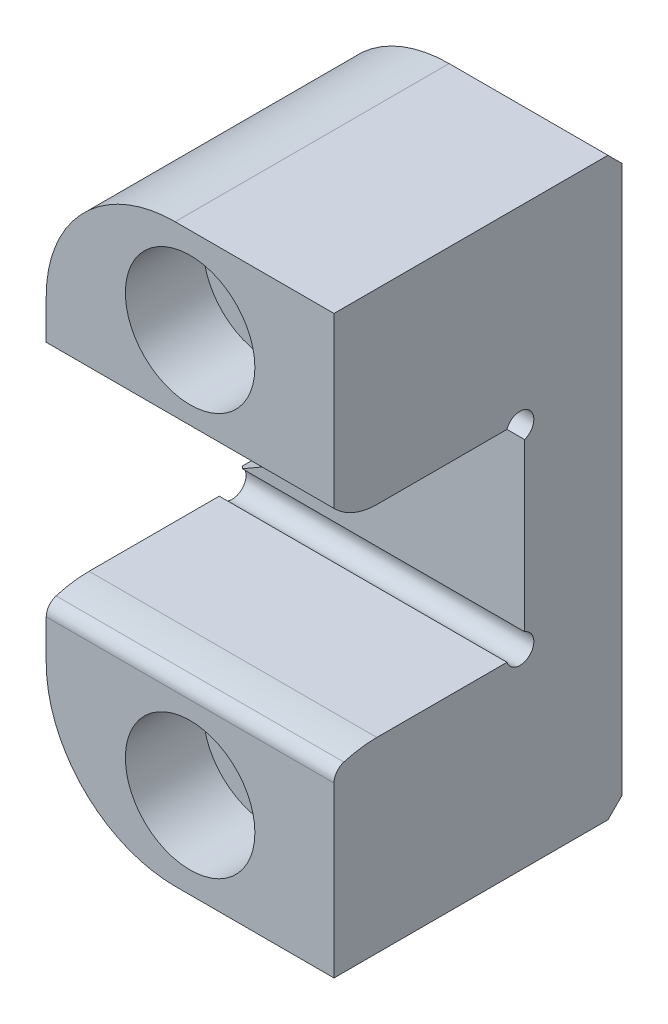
ISO-10303-21;
HEADER;
FILE_DESCRIPTION(('STEP AP214'),'2;1');
FILE_NAME('part.step','',(''),(''),'','','');
FILE_SCHEMA(('AUTOMOTIVE_DESIGN { 1 0 10303 214 1 1 1 1 }'));
ENDSEC;
DATA;
#1=APPLICATION_CONTEXT('core data for automotive mechanical design processes');
#2=APPLICATION_PROTOCOL_DEFINITION('international standard','automotive_design',2000,#1);
#3=PRODUCT_CONTEXT('',#1,'mechanical');
#4=PRODUCT('Part','Part','',(#3));
#5=PRODUCT_RELATED_PRODUCT_CATEGORY('part','',(#4));
#6=PRODUCT_DEFINITION_FORMATION('','',#4);
#7=PRODUCT_DEFINITION_CONTEXT('part definition',#1,'design');
#8=PRODUCT_DEFINITION('design','',#6,#7);
#9=PRODUCT_DEFINITION_SHAPE('','',#8);
#10=(LENGTH_UNIT() NAMED_UNIT(*) SI_UNIT(.MILLI.,.METRE.));
#11=(NAMED_UNIT(*) PLANE_ANGLE_UNIT() SI_UNIT($,.RADIAN.));
#12=(NAMED_UNIT(*) SI_UNIT($,.STERADIAN.) SOLID_ANGLE_UNIT());
#13=UNCERTAINTY_MEASURE_WITH_UNIT(LENGTH_MEASURE(1.E-05),#10,'distance_accuracy_value','');
#14=(GEOMETRIC_REPRESENTATION_CONTEXT(3) GLOBAL_UNCERTAINTY_ASSIGNED_CONTEXT((#13)) GLOBAL_UNIT_ASSIGNED_CONTEXT((#10,
#11,#12)) REPRESENTATION_CONTEXT('',''));
#15=CARTESIAN_POINT('',(0.,0.,0.));
#16=DIRECTION('',(0.,0.,1.));
#17=DIRECTION('',(1.,0.,0.));
#18=AXIS2_PLACEMENT_3D('',#15,#16,#17);
#19=CARTESIAN_POINT('',(7.9375,15.875,0.));
#20=DIRECTION('',(0.,0.,-1.));
#21=DIRECTION('',(0.,1.,0.));
#22=AXIS2_PLACEMENT_3D('',#19,#20,#21);
#23=PLANE('',#22);
#24=DIRECTION('',(0.,-1.,0.));
#25=VECTOR('',#24,1.);
#26=CARTESIAN_POINT('',(-7.9375,15.875,0.));
#27=LINE('',#26,#25);
#28=CARTESIAN_POINT('',(-7.9375,8.763,0.));
#29=VERTEX_POINT('',#28);
#30=CARTESIAN_POINT('',(-7.9375,6.5586198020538,0.));
#31=VERTEX_POINT('',#30);
#32=EDGE_CURVE('E230',#29,#31,#27,.T.);
#33=ORIENTED_EDGE('',*,*,#32,.T.);
#34=DIRECTION('',(1.,0.,0.));
#35=VECTOR('',#34,1.);
#36=CARTESIAN_POINT('',(-7.9375,6.5586198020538,0.));
#37=LINE('',#36,#35);
#38=CARTESIAN_POINT('',(7.9375,6.5586198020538,0.));
#39=VERTEX_POINT('',#38);
#40=EDGE_CURVE('E377',#31,#39,#37,.T.);
#41=ORIENTED_EDGE('',*,*,#40,.T.);
#42=DIRECTION('',(0.,-1.,0.));
#43=VECTOR('',#42,1.);
#44=CARTESIAN_POINT('',(7.9375,15.875,0.));
#45=LINE('',#44,#43);
#46=CARTESIAN_POINT('',(7.9375,15.875,0.));
#47=VERTEX_POINT('',#46);
#48=EDGE_CURVE('E227',#47,#39,#45,.T.);
#49=ORIENTED_EDGE('',*,*,#48,.F.);
#50=DIRECTION('',(-1.,0.,0.));
#51=VECTOR('',#50,1.);
#52=CARTESIAN_POINT('',(7.9375,15.875,0.));
#53=LINE('',#52,#51);
#54=CARTESIAN_POINT('',(-0.8255,15.875,0.));
#55=VERTEX_POINT('',#54);
#56=EDGE_CURVE('E234',#47,#55,#53,.T.);
#57=ORIENTED_EDGE('',*,*,#56,.T.);
#58=CARTESIAN_POINT('',(-0.8255,8.763,0.));
#59=DIRECTION('',(0.,0.,-1.));
#60=DIRECTION('',(0.,1.,0.));
#61=AXIS2_PLACEMENT_3D('',#58,#59,#60);
#62=CIRCLE('',#61,7.112);
#63=EDGE_CURVE('E252',#55,#29,#62,.F.);
#64=ORIENTED_EDGE('',*,*,#63,.T.);
#65=EDGE_LOOP('',(#33,#41,#49,#57,#64));
#66=FACE_BOUND('',#65,.T.);
#67=CARTESIAN_POINT('',(0.,11.1125,0.));
#68=DIRECTION('',(0.,0.,1.));
#69=DIRECTION('',(1.,0.,0.));
#70=AXIS2_PLACEMENT_3D('',#67,#68,#69);
#71=CIRCLE('',#70,3.57251);
#72=CARTESIAN_POINT('',(3.57251,11.1125,0.));
#73=VERTEX_POINT('',#72);
#74=EDGE_CURVE('E307',#73,#73,#71,.T.);
#75=ORIENTED_EDGE('',*,*,#74,.F.);
#76=EDGE_LOOP('',(#75));
#77=FACE_BOUND('',#76,.T.);
#78=ADVANCED_FACE('F32',(#66,#77),#23,.F.);
#79=CARTESIAN_POINT('',(7.9375,5.5626,-10.5156));
#80=DIRECTION('',(0.,0.,-1.));
#81=DIRECTION('',(-1.,0.,0.));
#82=AXIS2_PLACEMENT_3D('',#79,#80,#81);
#83=PLANE('',#82);
#84=DIRECTION('',(-0.866025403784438,0.500000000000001,0.));
#85=VECTOR('',#84,1.);
#86=CARTESIAN_POINT('',(3.62229653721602,-1.91155164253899,-10.5156));
#87=LINE('',#86,#85);
#88=CARTESIAN_POINT('',(-5.32911357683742,3.25654739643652,-10.5156));
#89=VERTEX_POINT('',#88);
#90=CARTESIAN_POINT('',(-7.6390321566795,4.59017951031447,-10.5156));
#91=VERTEX_POINT('',#90);
#92=EDGE_CURVE('E351',#89,#91,#87,.T.);
#93=ORIENTED_EDGE('',*,*,#92,.F.);
#94=DIRECTION('',(0.,-1.,0.));
#95=VECTOR('',#94,1.);
#96=CARTESIAN_POINT('',(-5.32911357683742,-3.84595644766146,-10.5156));
#97=LINE('',#96,#95);
#98=CARTESIAN_POINT('',(-5.32911357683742,-3.25654739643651,-10.5156));
#99=VERTEX_POINT('',#98);
#100=EDGE_CURVE('E264',#89,#99,#97,.T.);
#101=ORIENTED_EDGE('',*,*,#100,.T.);
#102=DIRECTION('',(0.866025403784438,0.500000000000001,0.));
#103=VECTOR('',#102,1.);
#104=CARTESIAN_POINT('',(8.43964944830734,4.69285164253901,-10.5156));
#105=LINE('',#104,#103);
#106=CARTESIAN_POINT('',(-7.63903215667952,-4.59017951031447,-10.5156));
#107=VERTEX_POINT('',#106);
#108=EDGE_CURVE('E349',#107,#99,#105,.T.);
#109=ORIENTED_EDGE('',*,*,#108,.F.);
#110=DIRECTION('',(1.,0.,0.));
#111=VECTOR('',#110,1.);
#112=CARTESIAN_POINT('',(-7.9375,-4.59017951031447,-10.5156));
#113=LINE('',#112,#111);
#114=CARTESIAN_POINT('',(7.9375,-4.59017951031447,-10.5156));
#115=VERTEX_POINT('',#114);
#116=EDGE_CURVE('E206',#107,#115,#113,.T.);
#117=ORIENTED_EDGE('',*,*,#116,.T.);
#118=DIRECTION('',(0.,-1.,0.));
#119=VECTOR('',#118,1.);
#120=CARTESIAN_POINT('',(7.9375,5.5626,-10.5156));
#121=LINE('',#120,#119);
#122=CARTESIAN_POINT('',(7.9375,4.59017951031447,-10.5156));
#123=VERTEX_POINT('',#122);
#124=EDGE_CURVE('E359',#123,#115,#121,.T.);
#125=ORIENTED_EDGE('',*,*,#124,.F.);
#126=DIRECTION('',(1.,0.,0.));
#127=VECTOR('',#126,1.);
#128=CARTESIAN_POINT('',(-7.9375,4.59017951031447,-10.5156));
#129=LINE('',#128,#127);
#130=EDGE_CURVE('E423',#123,#91,#129,.F.);
#131=ORIENTED_EDGE('',*,*,#130,.T.);
#132=EDGE_LOOP('',(#93,#101,#109,#117,#125,#131));
#133=FACE_BOUND('',#132,.T.);
#134=ADVANCED_FACE('F419',(#133),#83,.F.);
#135=CARTESIAN_POINT('',(7.9375,15.875,-15.875));
#136=DIRECTION('',(0.,0.,1.));
#137=DIRECTION('',(0.,-1.,0.));
#138=AXIS2_PLACEMENT_3D('',#135,#136,#137);
#139=PLANE('',#138);
#140=CARTESIAN_POINT('',(0.,11.1125,-15.875));
#141=DIRECTION('',(0.,0.,1.));
#142=DIRECTION('',(1.,0.,0.));
#143=AXIS2_PLACEMENT_3D('',#140,#141,#142);
#144=CIRCLE('',#143,2.15265);
#145=CARTESIAN_POINT('',(2.15265,11.1125,-15.875));
#146=VERTEX_POINT('',#145);
#147=EDGE_CURVE('E775',#146,#146,#144,.T.);
#148=ORIENTED_EDGE('',*,*,#147,.T.);
#149=EDGE_LOOP('',(#148));
#150=FACE_BOUND('',#149,.T.);
#151=CARTESIAN_POINT('',(0.,-11.1125,-15.875));
#152=DIRECTION('',(0.,0.,1.));
#153=DIRECTION('',(1.,0.,0.));
#154=AXIS2_PLACEMENT_3D('',#151,#152,#153);
#155=CIRCLE('',#154,2.15265);
#156=CARTESIAN_POINT('',(2.15265,-11.1125,-15.875));
#157=VERTEX_POINT('',#156);
#158=EDGE_CURVE('E456',#157,#157,#155,.T.);
#159=ORIENTED_EDGE('',*,*,#158,.T.);
#160=EDGE_LOOP('',(#159));
#161=FACE_BOUND('',#160,.T.);
#162=CARTESIAN_POINT('',(-0.8255,-8.763,-15.875));
#163=DIRECTION('',(0.,0.,1.));
#164=DIRECTION('',(0.,-1.,0.));
#165=AXIS2_PLACEMENT_3D('',#162,#163,#164);
#166=CIRCLE('',#165,6.35);
#167=CARTESIAN_POINT('',(-0.8255,-15.113,-15.875));
#168=VERTEX_POINT('',#167);
#169=CARTESIAN_POINT('',(-7.1755,-8.763,-15.875));
#170=VERTEX_POINT('',#169);
#171=EDGE_CURVE('E280',#168,#170,#166,.F.);
#172=ORIENTED_EDGE('',*,*,#171,.T.);
#173=DIRECTION('',(0.,1.,0.));
#174=VECTOR('',#173,1.);
#175=CARTESIAN_POINT('',(-7.1755,15.875,-15.875));
#176=LINE('',#175,#174);
#177=CARTESIAN_POINT('',(-7.17550000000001,-4.32255909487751,-15.875));
#178=VERTEX_POINT('',#177);
#179=EDGE_CURVE('E282',#170,#178,#176,.T.);
#180=ORIENTED_EDGE('',*,*,#179,.T.);
#181=DIRECTION('',(0.866025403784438,0.500000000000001,0.));
#182=VECTOR('',#181,1.);
#183=CARTESIAN_POINT('',(-6.35,-3.84595644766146,-15.875));
#184=LINE('',#183,#182);
#185=CARTESIAN_POINT('',(-6.35,-3.84595644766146,-15.875));
#186=VERTEX_POINT('',#185);
#187=EDGE_CURVE('E333',#178,#186,#184,.T.);
#188=ORIENTED_EDGE('',*,*,#187,.T.);
#189=DIRECTION('',(0.,1.,0.));
#190=VECTOR('',#189,1.);
#191=CARTESIAN_POINT('',(-6.35,3.84595644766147,-15.875));
#192=LINE('',#191,#190);
#193=CARTESIAN_POINT('',(-6.35,3.84595644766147,-15.875));
#194=VERTEX_POINT('',#193);
#195=EDGE_CURVE('E332',#186,#194,#192,.T.);
#196=ORIENTED_EDGE('',*,*,#195,.T.);
#197=DIRECTION('',(-0.866025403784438,0.500000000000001,0.));
#198=VECTOR('',#197,1.);
#199=CARTESIAN_POINT('',(-6.35,3.84595644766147,-15.875));
#200=LINE('',#199,#198);
#201=CARTESIAN_POINT('',(-7.1755,4.32255909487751,-15.875));
#202=VERTEX_POINT('',#201);
#203=EDGE_CURVE('E326',#194,#202,#200,.T.);
#204=ORIENTED_EDGE('',*,*,#203,.T.);
#205=DIRECTION('',(0.,1.,0.));
#206=VECTOR('',#205,1.);
#207=CARTESIAN_POINT('',(-7.17549999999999,15.875,-15.875));
#208=LINE('',#207,#206);
#209=CARTESIAN_POINT('',(-7.1755,8.763,-15.875));
#210=VERTEX_POINT('',#209);
#211=EDGE_CURVE('E274',#202,#210,#208,.T.);
#212=ORIENTED_EDGE('',*,*,#211,.T.);
#213=CARTESIAN_POINT('',(-0.8255,8.763,-15.875));
#214=DIRECTION('',(0.,0.,1.));
#215=DIRECTION('',(0.,-1.,0.));
#216=AXIS2_PLACEMENT_3D('',#213,#214,#215);
#217=CIRCLE('',#216,6.35);
#218=CARTESIAN_POINT('',(-0.8255,15.113,-15.875));
#219=VERTEX_POINT('',#218);
#220=EDGE_CURVE('E272',#210,#219,#217,.F.);
#221=ORIENTED_EDGE('',*,*,#220,.T.);
#222=DIRECTION('',(1.,0.,0.));
#223=VECTOR('',#222,1.);
#224=CARTESIAN_POINT('',(7.9375,15.113,-15.875));
#225=LINE('',#224,#223);
#226=CARTESIAN_POINT('',(7.9375,15.113,-15.875));
#227=VERTEX_POINT('',#226);
#228=EDGE_CURVE('E276',#219,#227,#225,.T.);
#229=ORIENTED_EDGE('',*,*,#228,.T.);
#230=DIRECTION('',(0.,1.,0.));
#231=VECTOR('',#230,1.);
#232=CARTESIAN_POINT('',(7.9375,15.875,-15.875));
#233=LINE('',#232,#231);
#234=CARTESIAN_POINT('',(7.9375,-15.113,-15.875));
#235=VERTEX_POINT('',#234);
#236=EDGE_CURVE('E368',#235,#227,#233,.T.);
#237=ORIENTED_EDGE('',*,*,#236,.F.);
#238=DIRECTION('',(-1.,0.,0.));
#239=VECTOR('',#238,1.);
#240=CARTESIAN_POINT('',(7.9375,-15.113,-15.875));
#241=LINE('',#240,#239);
#242=EDGE_CURVE('E278',#235,#168,#241,.T.);
#243=ORIENTED_EDGE('',*,*,#242,.T.);
#244=EDGE_LOOP('',(#172,#180,#188,#196,#204,#212,#221,#229,#237,#243));
#245=FACE_BOUND('',#244,.T.);
#246=ADVANCED_FACE('F330',(#150,#161,#245),#139,.F.);
#247=CARTESIAN_POINT('',(-7.9375,15.875,0.));
#248=DIRECTION('',(1.,0.,0.));
#249=DIRECTION('',(0.,0.,-1.));
#250=AXIS2_PLACEMENT_3D('',#247,#248,#249);
#251=PLANE('',#250);
#252=DIRECTION('',(0.,0.,1.));
#253=VECTOR('',#252,1.);
#254=CARTESIAN_POINT('',(-7.9375,8.763,0.));
#255=LINE('',#254,#253);
#256=CARTESIAN_POINT('',(-7.9375,8.763,-15.113));
#257=VERTEX_POINT('',#256);
#258=EDGE_CURVE('E244',#29,#257,#255,.F.);
#259=ORIENTED_EDGE('',*,*,#258,.T.);
#260=DIRECTION('',(0.,-1.,0.));
#261=VECTOR('',#260,1.);
#262=CARTESIAN_POINT('',(-7.9375,15.875,-15.113));
#263=LINE('',#262,#261);
#264=CARTESIAN_POINT('',(-7.9375,4.76250000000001,-15.113));
#265=VERTEX_POINT('',#264);
#266=EDGE_CURVE('E54',#257,#265,#263,.T.);
#267=ORIENTED_EDGE('',*,*,#266,.T.);
#268=DIRECTION('',(0.,0.,-1.));
#269=VECTOR('',#268,1.);
#270=CARTESIAN_POINT('',(-7.9375,4.76250000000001,0.));
#271=LINE('',#270,#269);
#272=CARTESIAN_POINT('',(-7.9375,4.76250000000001,-10.7930308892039));
#273=VERTEX_POINT('',#272);
#274=EDGE_CURVE('E256',#273,#265,#271,.T.);
#275=ORIENTED_EDGE('',*,*,#274,.F.);
#276=CARTESIAN_POINT('',(-7.9375,5.3086,-10.2616));
#277=DIRECTION('',(1.,0.,0.));
#278=DIRECTION('',(0.,0.,-1.));
#279=AXIS2_PLACEMENT_3D('',#276,#277,#278);
#280=CIRCLE('',#279,0.762000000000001);
#281=CARTESIAN_POINT('',(-7.9375,5.5626,-9.54317951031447));
#282=VERTEX_POINT('',#281);
#283=EDGE_CURVE('E427',#273,#282,#280,.T.);
#284=ORIENTED_EDGE('',*,*,#283,.T.);
#285=DIRECTION('',(0.,0.,-1.));
#286=VECTOR('',#285,1.);
#287=CARTESIAN_POINT('',(-7.9375,5.5626,0.));
#288=LINE('',#287,#286);
#289=CARTESIAN_POINT('',(-7.9375,5.5626,-2.36219999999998));
#290=VERTEX_POINT('',#289);
#291=EDGE_CURVE('E224',#290,#282,#288,.T.);
#292=ORIENTED_EDGE('',*,*,#291,.F.);
#293=CARTESIAN_POINT('',(-7.9375,8.86175342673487,-2.36219999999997));
#294=DIRECTION('',(-1.,0.,0.));
#295=DIRECTION('',(0.,0.,-1.));
#296=AXIS2_PLACEMENT_3D('',#293,#294,#295);
#297=CIRCLE('',#296,3.29915342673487);
#298=EDGE_CURVE('E382',#290,#31,#297,.T.);
#299=ORIENTED_EDGE('',*,*,#298,.T.);
#300=ORIENTED_EDGE('',*,*,#32,.F.);
#301=EDGE_LOOP('',(#259,#267,#275,#284,#292,#299,#300));
#302=FACE_BOUND('',#301,.T.);
#303=ADVANCED_FACE('F380',(#302),#251,.F.);
#304=DIRECTION('',(0.,0.,1.));
#305=VECTOR('',#304,1.);
#306=CARTESIAN_POINT('',(-7.9375,-4.7625,0.));
#307=LINE('',#306,#305);
#308=CARTESIAN_POINT('',(-7.9375,-4.7625,-15.113));
#309=VERTEX_POINT('',#308);
#310=CARTESIAN_POINT('',(-7.9375,-4.7625,-10.7930308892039));
#311=VERTEX_POINT('',#310);
#312=EDGE_CURVE('E254',#309,#311,#307,.T.);
#313=ORIENTED_EDGE('',*,*,#312,.F.);
#314=DIRECTION('',(0.,-1.,0.));
#315=VECTOR('',#314,1.);
#316=CARTESIAN_POINT('',(-7.9375,15.875,-15.113));
#317=LINE('',#316,#315);
#318=CARTESIAN_POINT('',(-7.9375,-8.763,-15.113));
#319=VERTEX_POINT('',#318);
#320=EDGE_CURVE('E287',#309,#319,#317,.T.);
#321=ORIENTED_EDGE('',*,*,#320,.T.);
#322=DIRECTION('',(0.,0.,-1.));
#323=VECTOR('',#322,1.);
#324=CARTESIAN_POINT('',(-7.9375,-8.763,0.));
#325=LINE('',#324,#323);
#326=CARTESIAN_POINT('',(-7.9375,-8.763,0.));
#327=VERTEX_POINT('',#326);
#328=EDGE_CURVE('E246',#319,#327,#325,.F.);
#329=ORIENTED_EDGE('',*,*,#328,.T.);
#330=DIRECTION('',(0.,-1.,0.));
#331=VECTOR('',#330,1.);
#332=CARTESIAN_POINT('',(-7.9375,-5.5626,0.));
#333=LINE('',#332,#331);
#334=CARTESIAN_POINT('',(-7.9375,-6.5586198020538,0.));
#335=VERTEX_POINT('',#334);
#336=EDGE_CURVE('E223',#335,#327,#333,.T.);
#337=ORIENTED_EDGE('',*,*,#336,.F.);
#338=CARTESIAN_POINT('',(-7.9375,-6.5586198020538,-0.762000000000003));
#339=DIRECTION('',(-1.,0.,0.));
#340=DIRECTION('',(0.,0.,1.));
#341=AXIS2_PLACEMENT_3D('',#338,#339,#340);
#342=CIRCLE('',#341,0.762);
#343=CARTESIAN_POINT('',(-7.9375,-5.82853159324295,-0.543790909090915));
#344=VERTEX_POINT('',#343);
#345=EDGE_CURVE('E443',#335,#344,#342,.T.);
#346=ORIENTED_EDGE('',*,*,#345,.T.);
#347=CARTESIAN_POINT('',(-7.9375,-11.9126,-2.36219999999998));
#348=DIRECTION('',(-1.,0.,0.));
#349=DIRECTION('',(0.,0.,1.));
#350=AXIS2_PLACEMENT_3D('',#347,#348,#349);
#351=CIRCLE('',#350,6.35);
#352=CARTESIAN_POINT('',(-7.9375,-5.5626,-2.36219999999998));
#353=VERTEX_POINT('',#352);
#354=EDGE_CURVE('E222',#344,#353,#351,.T.);
#355=ORIENTED_EDGE('',*,*,#354,.T.);
#356=DIRECTION('',(0.,0.,1.));
#357=VECTOR('',#356,1.);
#358=CARTESIAN_POINT('',(-7.9375,-5.5626,-10.5156));
#359=LINE('',#358,#357);
#360=CARTESIAN_POINT('',(-7.9375,-5.5626,-9.54317951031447));
#361=VERTEX_POINT('',#360);
#362=EDGE_CURVE('E213',#361,#353,#359,.T.);
#363=ORIENTED_EDGE('',*,*,#362,.F.);
#364=CARTESIAN_POINT('',(-7.9375,-5.3086,-10.2616));
#365=DIRECTION('',(1.,0.,0.));
#366=DIRECTION('',(0.,0.,1.));
#367=AXIS2_PLACEMENT_3D('',#364,#365,#366);
#368=CIRCLE('',#367,0.762000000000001);
#369=EDGE_CURVE('E196',#361,#311,#368,.T.);
#370=ORIENTED_EDGE('',*,*,#369,.T.);
#371=EDGE_LOOP('',(#313,#321,#329,#337,#346,#355,#363,#370));
#372=FACE_BOUND('',#371,.T.);
#373=ADVANCED_FACE('F219',(#372),#251,.F.);
#374=CARTESIAN_POINT('',(7.9375,5.5626,0.));
#375=DIRECTION('',(0.,1.,0.));
#376=DIRECTION('',(0.,0.,1.));
#377=AXIS2_PLACEMENT_3D('',#374,#375,#376);
#378=PLANE('',#377);
#379=ORIENTED_EDGE('',*,*,#291,.T.);
#380=DIRECTION('',(1.,0.,0.));
#381=VECTOR('',#380,1.);
#382=CARTESIAN_POINT('',(-7.9375,5.5626,-9.54317951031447));
#383=LINE('',#382,#381);
#384=CARTESIAN_POINT('',(7.9375,5.5626,-9.54317951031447));
#385=VERTEX_POINT('',#384);
#386=EDGE_CURVE('E426',#282,#385,#383,.T.);
#387=ORIENTED_EDGE('',*,*,#386,.T.);
#388=DIRECTION('',(0.,0.,-1.));
#389=VECTOR('',#388,1.);
#390=CARTESIAN_POINT('',(7.9375,5.5626,0.));
#391=LINE('',#390,#389);
#392=CARTESIAN_POINT('',(7.9375,5.5626,-2.36219999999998));
#393=VERTEX_POINT('',#392);
#394=EDGE_CURVE('E356',#393,#385,#391,.T.);
#395=ORIENTED_EDGE('',*,*,#394,.F.);
#396=DIRECTION('',(1.,0.,0.));
#397=VECTOR('',#396,1.);
#398=CARTESIAN_POINT('',(-7.9375,5.5626,-2.36219999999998));
#399=LINE('',#398,#397);
#400=EDGE_CURVE('E438',#290,#393,#399,.T.);
#401=ORIENTED_EDGE('',*,*,#400,.F.);
#402=EDGE_LOOP('',(#379,#387,#395,#401));
#403=FACE_BOUND('',#402,.T.);
#404=ADVANCED_FACE('F481',(#403),#378,.F.);
#405=CARTESIAN_POINT('',(7.9375,-5.5626,-10.5156));
#406=DIRECTION('',(0.,-1.,0.));
#407=DIRECTION('',(0.,0.,-1.));
#408=AXIS2_PLACEMENT_3D('',#405,#406,#407);
#409=PLANE('',#408);
#410=DIRECTION('',(0.,0.,1.));
#411=VECTOR('',#410,1.);
#412=CARTESIAN_POINT('',(7.9375,-5.5626,-10.5156));
#413=LINE('',#412,#411);
#414=CARTESIAN_POINT('',(7.9375,-5.5626,-9.54317951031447));
#415=VERTEX_POINT('',#414);
#416=CARTESIAN_POINT('',(7.9375,-5.5626,-2.36219999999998));
#417=VERTEX_POINT('',#416);
#418=EDGE_CURVE('E215',#415,#417,#413,.T.);
#419=ORIENTED_EDGE('',*,*,#418,.F.);
#420=DIRECTION('',(1.,0.,0.));
#421=VECTOR('',#420,1.);
#422=CARTESIAN_POINT('',(-7.9375,-5.5626,-9.54317951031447));
#423=LINE('',#422,#421);
#424=EDGE_CURVE('E199',#415,#361,#423,.F.);
#425=ORIENTED_EDGE('',*,*,#424,.T.);
#426=ORIENTED_EDGE('',*,*,#362,.T.);
#427=DIRECTION('',(1.,0.,0.));
#428=VECTOR('',#427,1.);
#429=CARTESIAN_POINT('',(-7.9375,-5.5626,-2.36219999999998));
#430=LINE('',#429,#428);
#431=EDGE_CURVE('E340',#353,#417,#430,.T.);
#432=ORIENTED_EDGE('',*,*,#431,.T.);
#433=EDGE_LOOP('',(#419,#425,#426,#432));
#434=FACE_BOUND('',#433,.T.);
#435=ADVANCED_FACE('F211',(#434),#409,.F.);
#436=CARTESIAN_POINT('',(7.9375,-5.5626,0.));
#437=DIRECTION('',(0.,0.,-1.));
#438=DIRECTION('',(0.,1.,0.));
#439=AXIS2_PLACEMENT_3D('',#436,#437,#438);
#440=PLANE('',#439);
#441=CARTESIAN_POINT('',(0.,-11.1125,0.));
#442=DIRECTION('',(0.,0.,1.));
#443=DIRECTION('',(1.,0.,0.));
#444=AXIS2_PLACEMENT_3D('',#441,#442,#443);
#445=CIRCLE('',#444,3.57251);
#446=CARTESIAN_POINT('',(3.57251,-11.1125,0.));
#447=VERTEX_POINT('',#446);
#448=EDGE_CURVE('E767',#447,#447,#445,.T.);
#449=ORIENTED_EDGE('',*,*,#448,.F.);
#450=EDGE_LOOP('',(#449));
#451=FACE_BOUND('',#450,.T.);
#452=DIRECTION('',(0.,-1.,0.));
#453=VECTOR('',#452,1.);
#454=CARTESIAN_POINT('',(7.9375,-5.5626,0.));
#455=LINE('',#454,#453);
#456=CARTESIAN_POINT('',(7.9375,-6.5586198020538,0.));
#457=VERTEX_POINT('',#456);
#458=CARTESIAN_POINT('',(7.9375,-15.875,0.));
#459=VERTEX_POINT('',#458);
#460=EDGE_CURVE('E363',#457,#459,#455,.T.);
#461=ORIENTED_EDGE('',*,*,#460,.F.);
#462=DIRECTION('',(1.,0.,0.));
#463=VECTOR('',#462,1.);
#464=CARTESIAN_POINT('',(-7.9375,-6.5586198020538,0.));
#465=LINE('',#464,#463);
#466=EDGE_CURVE('E337',#335,#457,#465,.T.);
#467=ORIENTED_EDGE('',*,*,#466,.F.);
#468=ORIENTED_EDGE('',*,*,#336,.T.);
#469=CARTESIAN_POINT('',(-0.8255,-8.763,0.));
#470=DIRECTION('',(0.,0.,-1.));
#471=DIRECTION('',(0.,1.,0.));
#472=AXIS2_PLACEMENT_3D('',#469,#470,#471);
#473=CIRCLE('',#472,7.112);
#474=CARTESIAN_POINT('',(-0.8255,-15.875,0.));
#475=VERTEX_POINT('',#474);
#476=EDGE_CURVE('E248',#327,#475,#473,.F.);
#477=ORIENTED_EDGE('',*,*,#476,.T.);
#478=DIRECTION('',(-1.,0.,0.));
#479=VECTOR('',#478,1.);
#480=CARTESIAN_POINT('',(7.9375,-15.875,0.));
#481=LINE('',#480,#479);
#482=EDGE_CURVE('E237',#459,#475,#481,.T.);
#483=ORIENTED_EDGE('',*,*,#482,.F.);
#484=EDGE_LOOP('',(#461,#467,#468,#477,#483));
#485=FACE_BOUND('',#484,.T.);
#486=ADVANCED_FACE('F553',(#451,#485),#440,.F.);
#487=CARTESIAN_POINT('',(7.9375,-15.875,0.));
#488=DIRECTION('',(0.,1.,0.));
#489=DIRECTION('',(0.,0.,1.));
#490=AXIS2_PLACEMENT_3D('',#487,#488,#489);
#491=PLANE('',#490);
#492=DIRECTION('',(0.,0.,-1.));
#493=VECTOR('',#492,1.);
#494=CARTESIAN_POINT('',(-0.8255,-15.875,0.));
#495=LINE('',#494,#493);
#496=CARTESIAN_POINT('',(-0.8255,-15.875,-15.113));
#497=VERTEX_POINT('',#496);
#498=EDGE_CURVE('E241',#475,#497,#495,.T.);
#499=ORIENTED_EDGE('',*,*,#498,.T.);
#500=DIRECTION('',(1.,0.,0.));
#501=VECTOR('',#500,1.);
#502=CARTESIAN_POINT('',(7.9375,-15.875,-15.113));
#503=LINE('',#502,#501);
#504=CARTESIAN_POINT('',(7.9375,-15.875,-15.113));
#505=VERTEX_POINT('',#504);
#506=EDGE_CURVE('E291',#497,#505,#503,.T.);
#507=ORIENTED_EDGE('',*,*,#506,.T.);
#508=DIRECTION('',(0.,0.,-1.));
#509=VECTOR('',#508,1.);
#510=CARTESIAN_POINT('',(7.9375,-15.875,0.));
#511=LINE('',#510,#509);
#512=EDGE_CURVE('E365',#459,#505,#511,.T.);
#513=ORIENTED_EDGE('',*,*,#512,.F.);
#514=ORIENTED_EDGE('',*,*,#482,.T.);
#515=EDGE_LOOP('',(#499,#507,#513,#514));
#516=FACE_BOUND('',#515,.T.);
#517=ADVANCED_FACE('F547',(#516),#491,.F.);
#518=CARTESIAN_POINT('',(7.9375,15.875,0.));
#519=DIRECTION('',(0.,-1.,0.));
#520=DIRECTION('',(0.,0.,-1.));
#521=AXIS2_PLACEMENT_3D('',#518,#519,#520);
#522=PLANE('',#521);
#523=DIRECTION('',(0.,0.,1.));
#524=VECTOR('',#523,1.);
#525=CARTESIAN_POINT('',(7.9375,15.875,0.));
#526=LINE('',#525,#524);
#527=CARTESIAN_POINT('',(7.9375,15.875,-15.113));
#528=VERTEX_POINT('',#527);
#529=EDGE_CURVE('E238',#528,#47,#526,.T.);
#530=ORIENTED_EDGE('',*,*,#529,.F.);
#531=DIRECTION('',(-1.,0.,0.));
#532=VECTOR('',#531,1.);
#533=CARTESIAN_POINT('',(7.9375,15.875,-15.113));
#534=LINE('',#533,#532);
#535=CARTESIAN_POINT('',(-0.8255,15.875,-15.113));
#536=VERTEX_POINT('',#535);
#537=EDGE_CURVE('E297',#528,#536,#534,.T.);
#538=ORIENTED_EDGE('',*,*,#537,.T.);
#539=DIRECTION('',(0.,0.,1.));
#540=VECTOR('',#539,1.);
#541=CARTESIAN_POINT('',(-0.8255,15.875,0.));
#542=LINE('',#541,#540);
#543=EDGE_CURVE('E250',#536,#55,#542,.T.);
#544=ORIENTED_EDGE('',*,*,#543,.T.);
#545=ORIENTED_EDGE('',*,*,#56,.F.);
#546=EDGE_LOOP('',(#530,#538,#544,#545));
#547=FACE_BOUND('',#546,.T.);
#548=ADVANCED_FACE('F387',(#547),#522,.F.);
#549=CARTESIAN_POINT('',(7.9375,15.875,0.));
#550=DIRECTION('',(1.,0.,0.));
#551=DIRECTION('',(0.,0.,-1.));
#552=AXIS2_PLACEMENT_3D('',#549,#550,#551);
#553=PLANE('',#552);
#554=ORIENTED_EDGE('',*,*,#512,.T.);
#555=DIRECTION('',(0.,-0.707106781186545,0.70710678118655));
#556=VECTOR('',#555,1.);
#557=CARTESIAN_POINT('',(7.9375,-7.5565000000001,-23.4314999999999));
#558=LINE('',#557,#556);
#559=EDGE_CURVE('E295',#505,#235,#558,.F.);
#560=ORIENTED_EDGE('',*,*,#559,.T.);
#561=ORIENTED_EDGE('',*,*,#236,.T.);
#562=DIRECTION('',(0.,-0.707106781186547,-0.707106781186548));
#563=VECTOR('',#562,1.);
#564=CARTESIAN_POINT('',(7.9375,23.4315,-7.55649999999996));
#565=LINE('',#564,#563);
#566=EDGE_CURVE('E293',#227,#528,#565,.F.);
#567=ORIENTED_EDGE('',*,*,#566,.T.);
#568=ORIENTED_EDGE('',*,*,#529,.T.);
#569=ORIENTED_EDGE('',*,*,#48,.T.);
#570=CARTESIAN_POINT('',(7.9375,8.86175342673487,-2.36219999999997));
#571=DIRECTION('',(-1.,0.,0.));
#572=DIRECTION('',(0.,0.,-1.));
#573=AXIS2_PLACEMENT_3D('',#570,#571,#572);
#574=CIRCLE('',#573,3.29915342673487);
#575=EDGE_CURVE('E430',#393,#39,#574,.T.);
#576=ORIENTED_EDGE('',*,*,#575,.F.);
#577=ORIENTED_EDGE('',*,*,#394,.T.);
#578=CARTESIAN_POINT('',(7.9375,5.3086,-10.2616));
#579=DIRECTION('',(1.,0.,0.));
#580=DIRECTION('',(0.,0.,-1.));
#581=AXIS2_PLACEMENT_3D('',#578,#579,#580);
#582=CIRCLE('',#581,0.762000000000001);
#583=EDGE_CURVE('E216',#123,#385,#582,.T.);
#584=ORIENTED_EDGE('',*,*,#583,.F.);
#585=ORIENTED_EDGE('',*,*,#124,.T.);
#586=CARTESIAN_POINT('',(7.9375,-5.3086,-10.2616));
#587=DIRECTION('',(1.,0.,0.));
#588=DIRECTION('',(0.,0.,1.));
#589=AXIS2_PLACEMENT_3D('',#586,#587,#588);
#590=CIRCLE('',#589,0.762000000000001);
#591=EDGE_CURVE('E207',#415,#115,#590,.T.);
#592=ORIENTED_EDGE('',*,*,#591,.F.);
#593=ORIENTED_EDGE('',*,*,#418,.T.);
#594=CARTESIAN_POINT('',(7.9375,-11.9126,-2.36219999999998));
#595=DIRECTION('',(-1.,0.,0.));
#596=DIRECTION('',(0.,0.,1.));
#597=AXIS2_PLACEMENT_3D('',#594,#595,#596);
#598=CIRCLE('',#597,6.35);
#599=CARTESIAN_POINT('',(7.9375,-5.82853159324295,-0.543790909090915));
#600=VERTEX_POINT('',#599);
#601=EDGE_CURVE('E440',#600,#417,#598,.T.);
#602=ORIENTED_EDGE('',*,*,#601,.F.);
#603=CARTESIAN_POINT('',(7.9375,-6.5586198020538,-0.762000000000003));
#604=DIRECTION('',(-1.,0.,0.));
#605=DIRECTION('',(0.,0.,1.));
#606=AXIS2_PLACEMENT_3D('',#603,#604,#605);
#607=CIRCLE('',#606,0.762);
#608=EDGE_CURVE('E444',#457,#600,#607,.T.);
#609=ORIENTED_EDGE('',*,*,#608,.F.);
#610=ORIENTED_EDGE('',*,*,#460,.T.);
#611=EDGE_LOOP('',(#554,#560,#561,#567,#568,#569,#576,#577,#584,#585,#592,#593,#602,#609,#610));
#612=FACE_BOUND('',#611,.T.);
#613=ADVANCED_FACE('F391',(#612),#553,.T.);
#614=CARTESIAN_POINT('',(-0.8255,-8.763,0.));
#615=DIRECTION('',(0.,0.,-1.));
#616=DIRECTION('',(-1.,0.,0.));
#617=AXIS2_PLACEMENT_3D('',#614,#615,#616);
#618=CYLINDRICAL_SURFACE('',#617,7.112);
#619=ORIENTED_EDGE('',*,*,#328,.F.);
#620=CARTESIAN_POINT('',(-0.8255,-8.763,-15.113));
#621=DIRECTION('',(0.,0.,1.));
#622=DIRECTION('',(1.,0.,0.));
#623=AXIS2_PLACEMENT_3D('',#620,#621,#622);
#624=CIRCLE('',#623,7.112);
#625=EDGE_CURVE('E289',#319,#497,#624,.T.);
#626=ORIENTED_EDGE('',*,*,#625,.T.);
#627=ORIENTED_EDGE('',*,*,#498,.F.);
#628=ORIENTED_EDGE('',*,*,#476,.F.);
#629=EDGE_LOOP('',(#619,#626,#627,#628));
#630=FACE_BOUND('',#629,.T.);
#631=ADVANCED_FACE('F482',(#630),#618,.T.);
#632=CARTESIAN_POINT('',(-0.8255,8.763,0.));
#633=DIRECTION('',(0.,0.,1.));
#634=DIRECTION('',(0.,-1.,0.));
#635=AXIS2_PLACEMENT_3D('',#632,#633,#634);
#636=CYLINDRICAL_SURFACE('',#635,7.112);
#637=ORIENTED_EDGE('',*,*,#543,.F.);
#638=CARTESIAN_POINT('',(-0.8255,8.763,-15.113));
#639=DIRECTION('',(0.,0.,1.));
#640=DIRECTION('',(1.,0.,0.));
#641=AXIS2_PLACEMENT_3D('',#638,#639,#640);
#642=CIRCLE('',#641,7.112);
#643=EDGE_CURVE('E11',#536,#257,#642,.T.);
#644=ORIENTED_EDGE('',*,*,#643,.T.);
#645=ORIENTED_EDGE('',*,*,#258,.F.);
#646=ORIENTED_EDGE('',*,*,#63,.F.);
#647=EDGE_LOOP('',(#637,#644,#645,#646));
#648=FACE_BOUND('',#647,.T.);
#649=ADVANCED_FACE('F383',(#648),#636,.T.);
#650=CARTESIAN_POINT('',(-6.35,3.84595644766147,0.));
#651=DIRECTION('',(-1.,0.,0.));
#652=DIRECTION('',(0.,0.,1.));
#653=AXIS2_PLACEMENT_3D('',#650,#651,#652);
#654=PLANE('',#653);
#655=DIRECTION('',(0.,0.,-1.));
#656=VECTOR('',#655,1.);
#657=CARTESIAN_POINT('',(-6.35,-3.84595644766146,0.));
#658=LINE('',#657,#656);
#659=CARTESIAN_POINT('',(-6.35,-3.84595644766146,-14.3256000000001));
#660=VERTEX_POINT('',#659);
#661=EDGE_CURVE('E346',#660,#186,#658,.T.);
#662=ORIENTED_EDGE('',*,*,#661,.F.);
#663=DIRECTION('',(0.,1.,0.));
#664=VECTOR('',#663,1.);
#665=CARTESIAN_POINT('',(-6.35,3.84595644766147,-14.3256000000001));
#666=LINE('',#665,#664);
#667=CARTESIAN_POINT('',(-6.35,3.84595644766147,-14.3256000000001));
#668=VERTEX_POINT('',#667);
#669=EDGE_CURVE('E261',#660,#668,#666,.T.);
#670=ORIENTED_EDGE('',*,*,#669,.T.);
#671=DIRECTION('',(0.,0.,-1.));
#672=VECTOR('',#671,1.);
#673=CARTESIAN_POINT('',(-6.35,3.84595644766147,0.));
#674=LINE('',#673,#672);
#675=EDGE_CURVE('E344',#668,#194,#674,.T.);
#676=ORIENTED_EDGE('',*,*,#675,.T.);
#677=ORIENTED_EDGE('',*,*,#195,.F.);
#678=EDGE_LOOP('',(#662,#670,#676,#677));
#679=FACE_BOUND('',#678,.T.);
#680=ADVANCED_FACE('F413',(#679),#654,.T.);
#681=CARTESIAN_POINT('',(-6.35,3.84595644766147,0.));
#682=DIRECTION('',(-0.500000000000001,-0.866025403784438,0.));
#683=DIRECTION('',(0.866025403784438,-0.500000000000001,0.));
#684=AXIS2_PLACEMENT_3D('',#681,#682,#683);
#685=PLANE('',#684);
#686=ORIENTED_EDGE('',*,*,#274,.T.);
#687=DIRECTION('',(-0.654653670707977,0.377964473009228,0.654653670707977));
#688=VECTOR('',#687,1.);
#689=CARTESIAN_POINT('',(-13.5073571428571,7.97825852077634,-9.54314285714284));
#690=LINE('',#689,#688);
#691=EDGE_CURVE('E41',#265,#202,#690,.F.);
#692=ORIENTED_EDGE('',*,*,#691,.T.);
#693=ORIENTED_EDGE('',*,*,#203,.F.);
#694=ORIENTED_EDGE('',*,*,#675,.F.);
#695=DIRECTION('',(0.25597695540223,-0.147788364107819,0.955319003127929));
#696=VECTOR('',#695,1.);
#697=CARTESIAN_POINT('',(-6.35,3.84595644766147,-14.3256000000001));
#698=LINE('',#697,#696);
#699=EDGE_CURVE('E267',#668,#89,#698,.T.);
#700=ORIENTED_EDGE('',*,*,#699,.T.);
#701=ORIENTED_EDGE('',*,*,#92,.T.);
#702=CARTESIAN_POINT('',(-8.88337294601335,5.3086,-10.2616));
#703=DIRECTION('',(-0.500000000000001,-0.866025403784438,0.));
#704=DIRECTION('',(0.866025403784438,-0.500000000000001,0.));
#705=AXIS2_PLACEMENT_3D('',#702,#703,#704);
#706=ELLIPSE('',#705,1.524,0.762000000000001);
#707=EDGE_CURVE('E258',#273,#91,#706,.T.);
#708=ORIENTED_EDGE('',*,*,#707,.F.);
#709=EDGE_LOOP('',(#686,#692,#693,#694,#700,#701,#708));
#710=FACE_BOUND('',#709,.T.);
#711=ADVANCED_FACE('F324',(#710),#685,.T.);
#712=CARTESIAN_POINT('',(-6.35,-3.84595644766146,0.));
#713=DIRECTION('',(-0.500000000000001,0.866025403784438,0.));
#714=DIRECTION('',(-0.866025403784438,-0.500000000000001,0.));
#715=AXIS2_PLACEMENT_3D('',#712,#713,#714);
#716=PLANE('',#715);
#717=ORIENTED_EDGE('',*,*,#187,.F.);
#718=DIRECTION('',(0.654653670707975,0.377964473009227,-0.654653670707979));
#719=VECTOR('',#718,1.);
#720=CARTESIAN_POINT('',(-13.5073571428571,-7.97825852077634,-9.54314285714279));
#721=LINE('',#720,#719);
#722=EDGE_CURVE('E285',#178,#309,#721,.F.);
#723=ORIENTED_EDGE('',*,*,#722,.T.);
#724=ORIENTED_EDGE('',*,*,#312,.T.);
#725=CARTESIAN_POINT('',(-8.88337294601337,-5.3086,-10.2616));
#726=DIRECTION('',(-0.500000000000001,0.866025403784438,0.));
#727=DIRECTION('',(0.866025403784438,0.500000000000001,0.));
#728=AXIS2_PLACEMENT_3D('',#725,#726,#727);
#729=ELLIPSE('',#728,1.524,0.762000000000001);
#730=EDGE_CURVE('E202',#107,#311,#729,.T.);
#731=ORIENTED_EDGE('',*,*,#730,.F.);
#732=ORIENTED_EDGE('',*,*,#108,.T.);
#733=DIRECTION('',(-0.25597695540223,-0.147788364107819,-0.955319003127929));
#734=VECTOR('',#733,1.);
#735=CARTESIAN_POINT('',(-6.05901173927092,-3.67795429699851,-13.239617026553));
#736=LINE('',#735,#734);
#737=EDGE_CURVE('E270',#99,#660,#736,.T.);
#738=ORIENTED_EDGE('',*,*,#737,.T.);
#739=ORIENTED_EDGE('',*,*,#661,.T.);
#740=EDGE_LOOP('',(#717,#723,#724,#731,#732,#738,#739));
#741=FACE_BOUND('',#740,.T.);
#742=ADVANCED_FACE('F408',(#741),#716,.T.);
#743=CARTESIAN_POINT('',(-7.9375,-11.9126,-2.36219999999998));
#744=DIRECTION('',(1.,0.,0.));
#745=DIRECTION('',(0.,0.,-1.));
#746=AXIS2_PLACEMENT_3D('',#743,#744,#745);
#747=CYLINDRICAL_SURFACE('',#746,6.35);
#748=ORIENTED_EDGE('',*,*,#601,.T.);
#749=ORIENTED_EDGE('',*,*,#431,.F.);
#750=ORIENTED_EDGE('',*,*,#354,.F.);
#751=DIRECTION('',(1.,0.,0.));
#752=VECTOR('',#751,1.);
#753=CARTESIAN_POINT('',(-7.9375,-5.82853159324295,-0.543790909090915));
#754=LINE('',#753,#752);
#755=EDGE_CURVE('E334',#344,#600,#754,.T.);
#756=ORIENTED_EDGE('',*,*,#755,.T.);
#757=EDGE_LOOP('',(#748,#749,#750,#756));
#758=FACE_BOUND('',#757,.T.);
#759=ADVANCED_FACE('F453',(#758),#747,.T.);
#760=CARTESIAN_POINT('',(-7.9375,-6.5586198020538,-0.762000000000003));
#761=DIRECTION('',(1.,0.,0.));
#762=DIRECTION('',(0.,0.,-1.));
#763=AXIS2_PLACEMENT_3D('',#760,#761,#762);
#764=CYLINDRICAL_SURFACE('',#763,0.762);
#765=ORIENTED_EDGE('',*,*,#608,.T.);
#766=ORIENTED_EDGE('',*,*,#755,.F.);
#767=ORIENTED_EDGE('',*,*,#345,.F.);
#768=ORIENTED_EDGE('',*,*,#466,.T.);
#769=EDGE_LOOP('',(#765,#766,#767,#768));
#770=FACE_BOUND('',#769,.T.);
#771=ADVANCED_FACE('F529',(#770),#764,.T.);
#772=CARTESIAN_POINT('',(-7.9375,8.86175342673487,-2.36219999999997));
#773=DIRECTION('',(1.,0.,0.));
#774=DIRECTION('',(0.,0.,-1.));
#775=AXIS2_PLACEMENT_3D('',#772,#773,#774);
#776=CYLINDRICAL_SURFACE('',#775,3.29915342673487);
#777=ORIENTED_EDGE('',*,*,#575,.T.);
#778=ORIENTED_EDGE('',*,*,#40,.F.);
#779=ORIENTED_EDGE('',*,*,#298,.F.);
#780=ORIENTED_EDGE('',*,*,#400,.T.);
#781=EDGE_LOOP('',(#777,#778,#779,#780));
#782=FACE_BOUND('',#781,.T.);
#783=ADVANCED_FACE('F526',(#782),#776,.T.);
#784=CARTESIAN_POINT('',(-7.9375,5.3086,-10.2616));
#785=DIRECTION('',(1.,0.,0.));
#786=DIRECTION('',(0.,0.,-1.));
#787=AXIS2_PLACEMENT_3D('',#784,#785,#786);
#788=CYLINDRICAL_SURFACE('',#787,0.762000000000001);
#789=ORIENTED_EDGE('',*,*,#283,.F.);
#790=ORIENTED_EDGE('',*,*,#707,.T.);
#791=ORIENTED_EDGE('',*,*,#130,.F.);
#792=ORIENTED_EDGE('',*,*,#583,.T.);
#793=ORIENTED_EDGE('',*,*,#386,.F.);
#794=EDGE_LOOP('',(#789,#790,#791,#792,#793));
#795=FACE_BOUND('',#794,.T.);
#796=ADVANCED_FACE('F523',(#795),#788,.F.);
#797=CARTESIAN_POINT('',(-7.9375,-5.3086,-10.2616));
#798=DIRECTION('',(1.,0.,0.));
#799=DIRECTION('',(0.,0.,-1.));
#800=AXIS2_PLACEMENT_3D('',#797,#798,#799);
#801=CYLINDRICAL_SURFACE('',#800,0.762000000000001);
#802=ORIENTED_EDGE('',*,*,#591,.T.);
#803=ORIENTED_EDGE('',*,*,#116,.F.);
#804=ORIENTED_EDGE('',*,*,#730,.T.);
#805=ORIENTED_EDGE('',*,*,#369,.F.);
#806=ORIENTED_EDGE('',*,*,#424,.F.);
#807=EDGE_LOOP('',(#802,#803,#804,#805,#806));
#808=FACE_BOUND('',#807,.T.);
#809=ADVANCED_FACE('F198',(#808),#801,.F.);
#810=CARTESIAN_POINT('',(0.,-11.1125,0.));
#811=DIRECTION('',(0.,0.,1.));
#812=DIRECTION('',(1.,0.,0.));
#813=AXIS2_PLACEMENT_3D('',#810,#811,#812);
#814=CYLINDRICAL_SURFACE('',#813,2.15265);
#815=ORIENTED_EDGE('',*,*,#158,.F.);
#816=EDGE_LOOP('',(#815));
#817=FACE_BOUND('',#816,.T.);
#818=CARTESIAN_POINT('',(0.,-11.1125,-4.30022));
#819=DIRECTION('',(0.,0.,1.));
#820=DIRECTION('',(1.,0.,0.));
#821=AXIS2_PLACEMENT_3D('',#818,#819,#820);
#822=CIRCLE('',#821,2.15265);
#823=CARTESIAN_POINT('',(2.15265,-11.1125,-4.30022));
#824=VERTEX_POINT('',#823);
#825=EDGE_CURVE('E459',#824,#824,#822,.T.);
#826=ORIENTED_EDGE('',*,*,#825,.T.);
#827=EDGE_LOOP('',(#826));
#828=FACE_BOUND('',#827,.T.);
#829=ADVANCED_FACE('F516',(#817,#828),#814,.F.);
#830=CARTESIAN_POINT('',(2.15265,-11.1125,-4.30022));
#831=DIRECTION('',(0.,0.,-1.));
#832=DIRECTION('',(-1.,0.,0.));
#833=AXIS2_PLACEMENT_3D('',#830,#831,#832);
#834=PLANE('',#833);
#835=ORIENTED_EDGE('',*,*,#825,.F.);
#836=EDGE_LOOP('',(#835));
#837=FACE_BOUND('',#836,.T.);
#838=CARTESIAN_POINT('',(0.,-11.1125,-4.30022));
#839=DIRECTION('',(0.,0.,1.));
#840=DIRECTION('',(1.,0.,0.));
#841=AXIS2_PLACEMENT_3D('',#838,#839,#840);
#842=CIRCLE('',#841,3.57251);
#843=CARTESIAN_POINT('',(3.57251,-11.1125,-4.30022));
#844=VERTEX_POINT('',#843);
#845=EDGE_CURVE('E774',#844,#844,#842,.T.);
#846=ORIENTED_EDGE('',*,*,#845,.T.);
#847=EDGE_LOOP('',(#846));
#848=FACE_BOUND('',#847,.T.);
#849=ADVANCED_FACE('F512',(#837,#848),#834,.F.);
#850=CARTESIAN_POINT('',(0.,-11.1125,0.));
#851=DIRECTION('',(0.,0.,1.));
#852=DIRECTION('',(1.,0.,0.));
#853=AXIS2_PLACEMENT_3D('',#850,#851,#852);
#854=CYLINDRICAL_SURFACE('',#853,3.57251);
#855=ORIENTED_EDGE('',*,*,#845,.F.);
#856=EDGE_LOOP('',(#855));
#857=FACE_BOUND('',#856,.T.);
#858=ORIENTED_EDGE('',*,*,#448,.T.);
#859=EDGE_LOOP('',(#858));
#860=FACE_BOUND('',#859,.T.);
#861=ADVANCED_FACE('F508',(#857,#860),#854,.F.);
#862=CARTESIAN_POINT('',(0.,11.1125,0.));
#863=DIRECTION('',(0.,0.,1.));
#864=DIRECTION('',(1.,0.,0.));
#865=AXIS2_PLACEMENT_3D('',#862,#863,#864);
#866=CYLINDRICAL_SURFACE('',#865,2.15265);
#867=ORIENTED_EDGE('',*,*,#147,.F.);
#868=EDGE_LOOP('',(#867));
#869=FACE_BOUND('',#868,.T.);
#870=CARTESIAN_POINT('',(0.,11.1125,-4.30022));
#871=DIRECTION('',(0.,0.,1.));
#872=DIRECTION('',(1.,0.,0.));
#873=AXIS2_PLACEMENT_3D('',#870,#871,#872);
#874=CIRCLE('',#873,2.15265);
#875=CARTESIAN_POINT('',(2.15265,11.1125,-4.30022));
#876=VERTEX_POINT('',#875);
#877=EDGE_CURVE('E780',#876,#876,#874,.T.);
#878=ORIENTED_EDGE('',*,*,#877,.T.);
#879=EDGE_LOOP('',(#878));
#880=FACE_BOUND('',#879,.T.);
#881=ADVANCED_FACE('F500',(#869,#880),#866,.F.);
#882=CARTESIAN_POINT('',(2.15265,11.1125,-4.30022));
#883=DIRECTION('',(0.,0.,-1.));
#884=DIRECTION('',(-1.,0.,0.));
#885=AXIS2_PLACEMENT_3D('',#882,#883,#884);
#886=PLANE('',#885);
#887=ORIENTED_EDGE('',*,*,#877,.F.);
#888=EDGE_LOOP('',(#887));
#889=FACE_BOUND('',#888,.T.);
#890=CARTESIAN_POINT('',(0.,11.1125,-4.30022));
#891=DIRECTION('',(0.,0.,1.));
#892=DIRECTION('',(1.,0.,0.));
#893=AXIS2_PLACEMENT_3D('',#890,#891,#892);
#894=CIRCLE('',#893,3.57251);
#895=CARTESIAN_POINT('',(3.57251,11.1125,-4.30022));
#896=VERTEX_POINT('',#895);
#897=EDGE_CURVE('E791',#896,#896,#894,.T.);
#898=ORIENTED_EDGE('',*,*,#897,.T.);
#899=EDGE_LOOP('',(#898));
#900=FACE_BOUND('',#899,.T.);
#901=ADVANCED_FACE('F494',(#889,#900),#886,.F.);
#902=CARTESIAN_POINT('',(0.,11.1125,0.));
#903=DIRECTION('',(0.,0.,1.));
#904=DIRECTION('',(1.,0.,0.));
#905=AXIS2_PLACEMENT_3D('',#902,#903,#904);
#906=CYLINDRICAL_SURFACE('',#905,3.57251);
#907=ORIENTED_EDGE('',*,*,#897,.F.);
#908=EDGE_LOOP('',(#907));
#909=FACE_BOUND('',#908,.T.);
#910=ORIENTED_EDGE('',*,*,#74,.T.);
#911=EDGE_LOOP('',(#910));
#912=FACE_BOUND('',#911,.T.);
#913=ADVANCED_FACE('F488',(#909,#912),#906,.F.);
#914=CARTESIAN_POINT('',(-6.35,3.84595644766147,-14.3256000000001));
#915=DIRECTION('',(-0.965925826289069,0.,0.258819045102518));
#916=DIRECTION('',(0.258819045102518,0.,0.965925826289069));
#917=AXIS2_PLACEMENT_3D('',#914,#915,#916);
#918=PLANE('',#917);
#919=ORIENTED_EDGE('',*,*,#737,.F.);
#920=ORIENTED_EDGE('',*,*,#100,.F.);
#921=ORIENTED_EDGE('',*,*,#699,.F.);
#922=ORIENTED_EDGE('',*,*,#669,.F.);
#923=EDGE_LOOP('',(#919,#920,#921,#922));
#924=FACE_BOUND('',#923,.T.);
#925=ADVANCED_FACE('F416',(#924),#918,.T.);
#926=CARTESIAN_POINT('',(7.9375,-15.113,-15.875));
#927=DIRECTION('',(0.,0.70710678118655,0.707106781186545));
#928=DIRECTION('',(0.,-0.707106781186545,0.70710678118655));
#929=AXIS2_PLACEMENT_3D('',#926,#927,#928);
#930=PLANE('',#929);
#931=ORIENTED_EDGE('',*,*,#559,.F.);
#932=ORIENTED_EDGE('',*,*,#506,.F.);
#933=DIRECTION('',(0.,-0.707106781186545,0.70710678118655));
#934=VECTOR('',#933,1.);
#935=CARTESIAN_POINT('',(-0.8255,-15.113,-15.875));
#936=LINE('',#935,#934);
#937=EDGE_CURVE('E305',#168,#497,#936,.T.);
#938=ORIENTED_EDGE('',*,*,#937,.F.);
#939=ORIENTED_EDGE('',*,*,#242,.F.);
#940=EDGE_LOOP('',(#931,#932,#938,#939));
#941=FACE_BOUND('',#940,.T.);
#942=ADVANCED_FACE('F397',(#941),#930,.F.);
#943=CARTESIAN_POINT('',(-0.8255,-8.763,-15.875));
#944=DIRECTION('',(0.,0.,1.));
#945=DIRECTION('',(1.,0.,0.));
#946=AXIS2_PLACEMENT_3D('',#943,#944,#945);
#947=CONICAL_SURFACE('',#946,6.35,0.785398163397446);
#948=ORIENTED_EDGE('',*,*,#937,.T.);
#949=ORIENTED_EDGE('',*,*,#625,.F.);
#950=DIRECTION('',(-0.707106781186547,0.,0.707106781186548));
#951=VECTOR('',#950,1.);
#952=CARTESIAN_POINT('',(-7.1755,-8.763,-15.875));
#953=LINE('',#952,#951);
#954=EDGE_CURVE('E302',#170,#319,#953,.T.);
#955=ORIENTED_EDGE('',*,*,#954,.F.);
#956=ORIENTED_EDGE('',*,*,#171,.F.);
#957=EDGE_LOOP('',(#948,#949,#955,#956));
#958=FACE_BOUND('',#957,.T.);
#959=ADVANCED_FACE('F403',(#958),#947,.T.);
#960=CARTESIAN_POINT('',(-7.1755,15.875,-15.875));
#961=DIRECTION('',(0.70710678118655,0.,0.707106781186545));
#962=DIRECTION('',(0.707106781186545,0.,-0.70710678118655));
#963=AXIS2_PLACEMENT_3D('',#960,#961,#962);
#964=PLANE('',#963);
#965=ORIENTED_EDGE('',*,*,#954,.T.);
#966=ORIENTED_EDGE('',*,*,#320,.F.);
#967=ORIENTED_EDGE('',*,*,#722,.F.);
#968=ORIENTED_EDGE('',*,*,#179,.F.);
#969=EDGE_LOOP('',(#965,#966,#967,#968));
#970=FACE_BOUND('',#969,.T.);
#971=ADVANCED_FACE('F464',(#970),#964,.F.);
#972=CARTESIAN_POINT('',(-7.17549999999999,15.875,-15.875));
#973=DIRECTION('',(0.707106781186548,0.,0.707106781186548));
#974=DIRECTION('',(0.707106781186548,0.,-0.707106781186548));
#975=AXIS2_PLACEMENT_3D('',#972,#973,#974);
#976=PLANE('',#975);
#977=ORIENTED_EDGE('',*,*,#691,.F.);
#978=ORIENTED_EDGE('',*,*,#266,.F.);
#979=DIRECTION('',(-0.707106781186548,0.,0.707106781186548));
#980=VECTOR('',#979,1.);
#981=CARTESIAN_POINT('',(-7.17549999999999,8.763,-15.875));
#982=LINE('',#981,#980);
#983=EDGE_CURVE('E36',#210,#257,#982,.T.);
#984=ORIENTED_EDGE('',*,*,#983,.F.);
#985=ORIENTED_EDGE('',*,*,#211,.F.);
#986=EDGE_LOOP('',(#977,#978,#984,#985));
#987=FACE_BOUND('',#986,.T.);
#988=ADVANCED_FACE('F34',(#987),#976,.F.);
#989=CARTESIAN_POINT('',(-0.8255,8.763,-15.875));
#990=DIRECTION('',(0.,0.,1.));
#991=DIRECTION('',(1.,0.,0.));
#992=AXIS2_PLACEMENT_3D('',#989,#990,#991);
#993=CONICAL_SURFACE('',#992,6.35,0.785398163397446);
#994=ORIENTED_EDGE('',*,*,#983,.T.);
#995=ORIENTED_EDGE('',*,*,#643,.F.);
#996=DIRECTION('',(0.,0.707106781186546,0.707106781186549));
#997=VECTOR('',#996,1.);
#998=CARTESIAN_POINT('',(-0.8255,15.113,-15.875));
#999=LINE('',#998,#997);
#1000=EDGE_CURVE('E308',#219,#536,#999,.T.);
#1001=ORIENTED_EDGE('',*,*,#1000,.F.);
#1002=ORIENTED_EDGE('',*,*,#220,.F.);
#1003=EDGE_LOOP('',(#994,#995,#1001,#1002));
#1004=FACE_BOUND('',#1003,.T.);
#1005=ADVANCED_FACE('F317',(#1004),#993,.T.);
#1006=CARTESIAN_POINT('',(7.9375,15.875,-15.113));
#1007=DIRECTION('',(0.,-0.707106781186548,0.707106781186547));
#1008=DIRECTION('',(0.,-0.707106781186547,-0.707106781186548));
#1009=AXIS2_PLACEMENT_3D('',#1006,#1007,#1008);
#1010=PLANE('',#1009);
#1011=ORIENTED_EDGE('',*,*,#566,.F.);
#1012=ORIENTED_EDGE('',*,*,#228,.F.);
#1013=ORIENTED_EDGE('',*,*,#1000,.T.);
#1014=ORIENTED_EDGE('',*,*,#537,.F.);
#1015=EDGE_LOOP('',(#1011,#1012,#1013,#1014));
#1016=FACE_BOUND('',#1015,.T.);
#1017=ADVANCED_FACE('F389',(#1016),#1010,.F.);
#1018=CLOSED_SHELL('',(#78,#134,#246,#303,#373,#404,#435,#486,#517,#548,#613,#631,#649,#680,
#711,#742,#759,#771,#783,#796,#809,#829,#849,#861,#881,#901,#913,#925,#942,#959,#971,#988,#1005,#1017));
#1019=MANIFOLD_SOLID_BREP('B2',#1018);
#1020=ADVANCED_BREP_SHAPE_REPRESENTATION('',(#18,#1019),#14);
#1021=SHAPE_DEFINITION_REPRESENTATION(#9,#1020);
ENDSEC;
END-ISO-10303-21;
